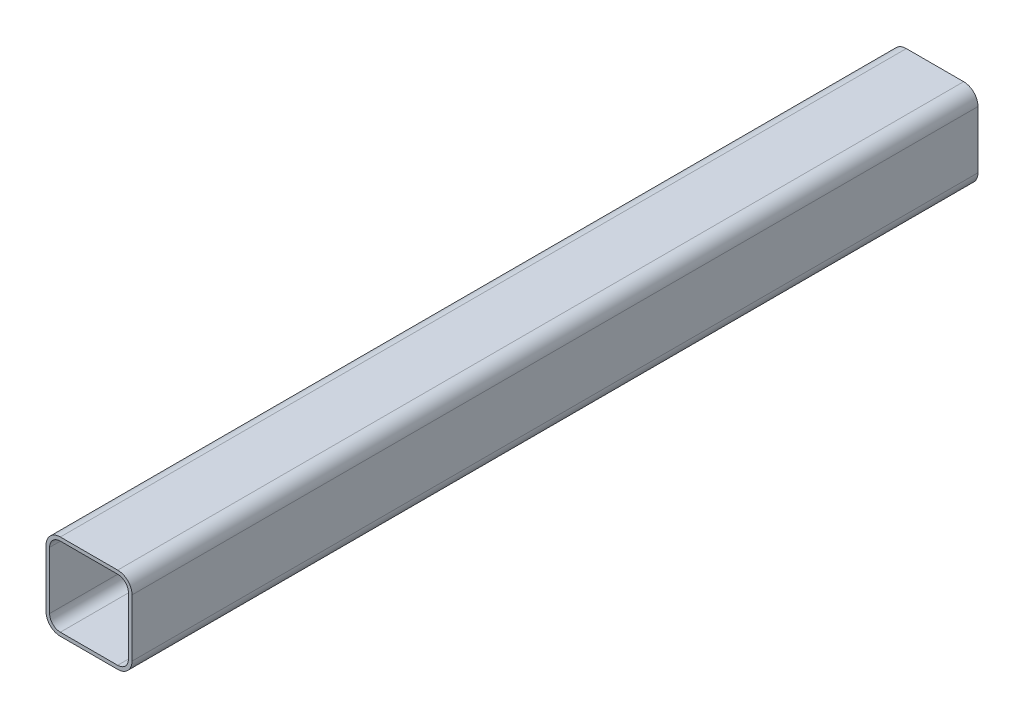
from build123d import *

# Parameters (mm, degrees)
BASE_EXTRUDE_THIN_DEPTH = 749.3


with BuildPart() as part:
    # Sketch1 → Base-Extrude-Thin (new body)
    with BuildSketch(Plane.XY):
        with BuildLine():
            Line((-25.4, 38.1), (25.4, 38.1))
            ThreePointArc((25.4, 38.1), (34.380256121, 34.380256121), (38.1, 25.4))
            Line((38.1, 25.4), (38.1, -25.4))
            ThreePointArc((38.1, -25.4), (34.380256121, -34.380256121), (25.4, -38.1))
            Line((25.4, -38.1), (-25.4, -38.1))
            ThreePointArc((-25.4, -38.1), (-34.380256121, -34.380256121), (-38.1, -25.4))
            Line((-38.1, -25.4), (-38.1, 25.4))
            ThreePointArc((-38.1, 25.4), (-34.380256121, 34.380256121), (-25.4, 38.1))
        make_face()
        with BuildLine():
            Line((-25.4, 34.925), (25.4, 34.925))
            ThreePointArc((25.4, 34.925), (32.135192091, 32.135192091), (34.925, 25.4))
            Line((34.925, 25.4), (34.925, -25.4))
            ThreePointArc((34.925, -25.4), (32.135192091, -32.135192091), (25.4, -34.925))
            Line((25.4, -34.925), (-25.4, -34.925))
            ThreePointArc((-25.4, -34.925), (-32.135192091, -32.135192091), (-34.925, -25.4))
            Line((-34.925, -25.4), (-34.925, 25.4))
            ThreePointArc((-34.925, 25.4), (-32.135192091, 32.135192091), (-25.4, 34.925))
        make_face(mode=Mode.SUBTRACT)
    extrude(amount=BASE_EXTRUDE_THIN_DEPTH)


solid = part.part
